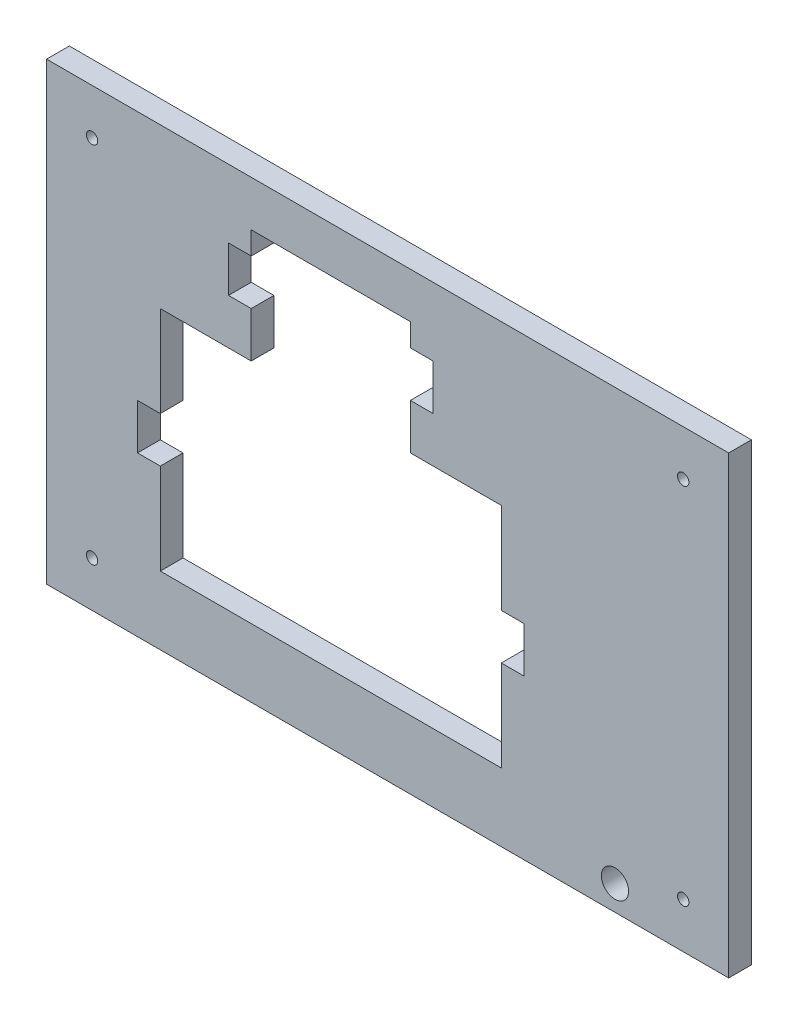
from build123d import *

# Parameters (mm, degrees)
ESQUISSE1_W                     = 300
ESQUISSE1_H                     = 200
EXTRUSION1_DEPTH                = 10
ENL_V_MAT_EXTRU_1_DEPTH         = 361.693775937
ESQUISSE3_R                     = 5
ENL_V_MAT_EXTRU_2_DEPTH         = 5
ESQUISSE4_R                     = 2.5
ENL_V_MAT_EXTRU_3_DEPTH         = 361.589794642
R_P_TITION_LIN_AIRE1_COUNT      = 2
R_P_TITION_LIN_AIRE1_PITCH      = 260
R_P_TITION_LIN_AIRE1_COUNT_DIR2 = 2
R_P_TITION_LIN_AIRE1_PITCH_DIR2 = 160
ESQUISSE5_R                     = 6
ENL_V_MAT_EXTRU_4_DEPTH         = 361.693775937


with BuildPart() as part:
    # Esquisse1 → Extrusion1 (new body)
    with BuildSketch(Plane.XY):
        with Locations((150, 100)):
            Rectangle(ESQUISSE1_W, ESQUISSE1_H)
    extrude(amount=-EXTRUSION1_DEPTH)

    # Esquisse2 → Enl_v. mat.-Extru.1 (cut, through all)
    with BuildSketch(Plane.XY):
        Polygon((50, 30), (200, 30), (200, 70), (210, 70), (210, 90), (200, 90), (200, 130), (160, 130), (160, 150), (170, 150), (170, 170), (160, 170), (160, 180), (90, 180), (90, 170), (80, 170), (80, 150), (90, 150), (90, 130), (50, 130), (50, 90), (40, 90), (40, 70), (50, 70), align=None)
    extrude(amount=-ENL_V_MAT_EXTRU_1_DEPTH, mode=Mode.SUBTRACT)

    # Esquisse3 → Enl_v. mat.-Extru.2 (cut)
    with BuildSketch(Plane(origin=(0, 0, -10), x_dir=(-1, 0, 0), z_dir=(0, 0, -1))):
        with Locations((-280, 180)):
            Circle(ESQUISSE3_R)
    enl_v_mat_extru_2 = extrude(amount=-ENL_V_MAT_EXTRU_2_DEPTH, mode=Mode.SUBTRACT)

    # Esquisse4 → Enl_v. mat.-Extru.3 (cut, through all)
    with BuildSketch(Plane(origin=(0, 0, -5), x_dir=(-1, 0, 0), z_dir=(0, 0, -1))):
        with Locations((-280, 180)):
            Circle(ESQUISSE4_R)
    enl_v_mat_extru_3 = extrude(amount=-ENL_V_MAT_EXTRU_3_DEPTH, mode=Mode.SUBTRACT)

    # R_p_tition lin_aire1: Enl_v. mat.-Extru.2, Enl_v. mat.-Extru.3 2 × 2
    with Locations(*[(-i * R_P_TITION_LIN_AIRE1_PITCH, -j * R_P_TITION_LIN_AIRE1_PITCH_DIR2, 0) for i in range(R_P_TITION_LIN_AIRE1_COUNT) for j in range(R_P_TITION_LIN_AIRE1_COUNT_DIR2) if (i, j) != (0, 0)]):
        add(enl_v_mat_extru_2, mode=Mode.SUBTRACT)
        add(enl_v_mat_extru_3, mode=Mode.SUBTRACT)

    # Esquisse5 → Enl_v. mat.-Extru.4 (cut, through all)
    with BuildSketch(Plane(origin=(0, 0, -10), x_dir=(-1, 0, 0), z_dir=(0, 0, -1))):
        with Locations((-250, 11)):
            Circle(ESQUISSE5_R)
    extrude(amount=-ENL_V_MAT_EXTRU_4_DEPTH, mode=Mode.SUBTRACT)


solid = part.part
